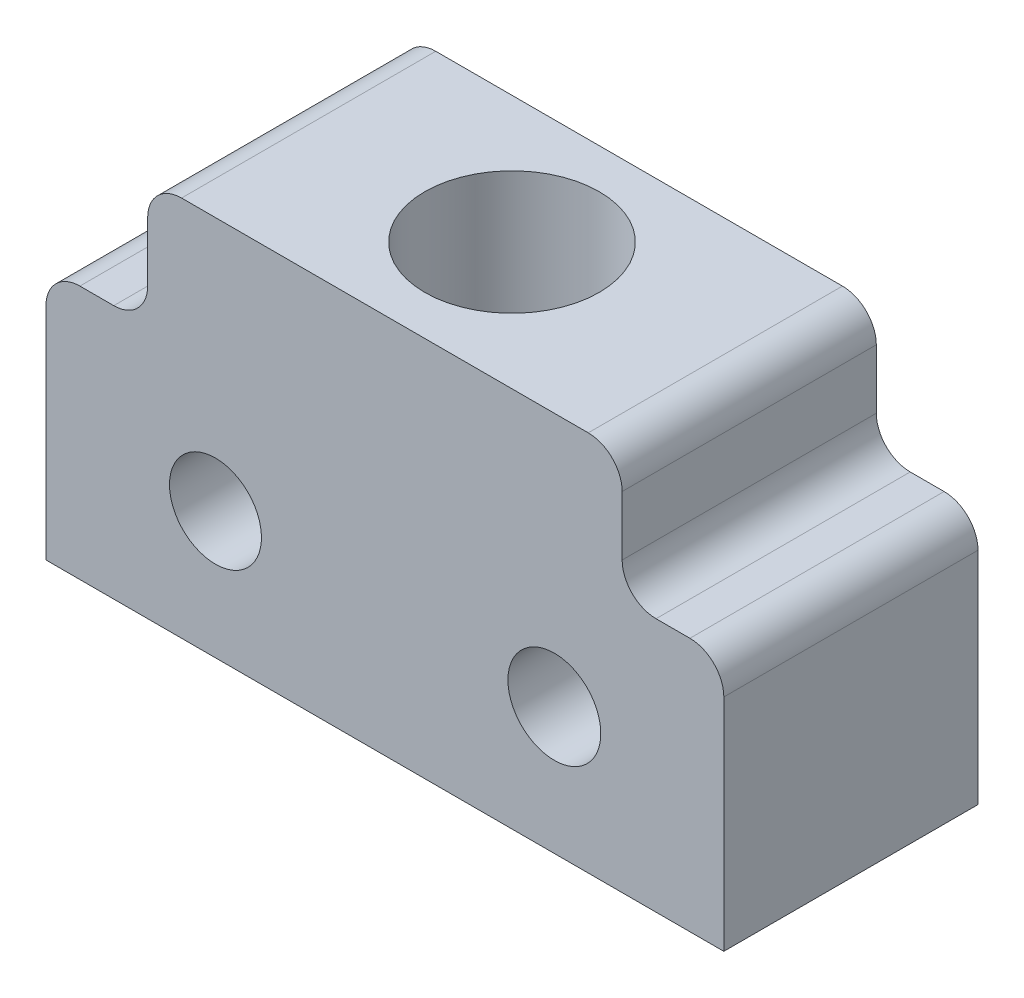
from build123d import *

# Parameters (mm, degrees)
SKETCH1_W           = 50.8
SKETCH1_H           = 19.05
BOSS_EXTRUDE1_DEPTH = 19.05
SKETCH3_R           = 3.175
CUT_EXTRUDE1_DEPTH  = 58.501695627
SKETCH4_R           = 3.130247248
CUT_EXTRUDE3_DEPTH  = 58.501695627
SKETCH6_W           = 35.56
SKETCH6_H           = 19.05
BOSS_EXTRUDE2_DEPTH = 9.525
SKETCH7_R           = 3.480096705
SKETCH7_R_2         = 3.446660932
CUT_EXTRUDE4_DEPTH  = 62.319435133
SKETCH8_R           = 4.445
CUT_EXTRUDE6_DEPTH  = 10.16
FILLET1_R           = 2.54
FILLET2_R           = 2.54
SKETCH9_R           = 6.35
CUT_EXTRUDE8_DEPTH  = 12.192
SKETCH10_R          = 6.5405
CUT_EXTRUDE9_DEPTH  = 10.668


with BuildPart() as part:
    # Sketch1 → Boss-Extrude1 (new body)
    with BuildSketch(Plane.XY):
        with Locations((25.4, 9.525)):
            Rectangle(SKETCH1_W, SKETCH1_H)
    extrude(amount=BOSS_EXTRUDE1_DEPTH)

    # Sketch3 → Cut-Extrude1 (cut, through all)
    with BuildSketch(Plane.XY.offset(19.05)):
        with Locations((12.7, 9.525)):
            Circle(SKETCH3_R)
    extrude(amount=-CUT_EXTRUDE1_DEPTH, mode=Mode.SUBTRACT)

    # Sketch4 → Cut-Extrude3 (cut, through all)
    with BuildSketch(Plane.XY.offset(19.05)):
        with Locations((38.1, 9.525)):
            Circle(SKETCH4_R)
    extrude(amount=-CUT_EXTRUDE3_DEPTH, mode=Mode.SUBTRACT)

    # Sketch6 → Boss-Extrude2 (add)
    with BuildSketch(Plane(origin=(0, 19.05, 0), x_dir=(1, 0, 0), z_dir=(0, 1, 0))):
        with Locations((25.4, -9.525)):
            Rectangle(SKETCH6_W, SKETCH6_H)
    extrude(amount=BOSS_EXTRUDE2_DEPTH)

    # Sketch7 → Cut-Extrude4 (cut, through all)
    with BuildSketch(Plane(origin=(0, 0, 0), x_dir=(-1, 0, 0), z_dir=(0, 0, -1))):
        with Locations((-38.1, 9.525)):
            Circle(SKETCH7_R)
        with Locations((-12.7, 9.525)):
            Circle(SKETCH7_R_2)
    extrude(amount=-CUT_EXTRUDE4_DEPTH, mode=Mode.SUBTRACT)

    # Sketch8 → Cut-Extrude6 (cut)
    with BuildSketch(Plane(origin=(0, 28.575, 0), x_dir=(1, 0, 0), z_dir=(0, 1, 0))):
        with Locations(Location((25.4, -9.525, 0), (0, 0, 270))):
            Circle(SKETCH8_R)
    extrude(amount=-CUT_EXTRUDE6_DEPTH, mode=Mode.SUBTRACT)

    # Fillet1
    fillet1_edges = [part.edges().sort_by_distance(p)[0] for p in [
        (7.62, 19.05, 9.525),
        (7.62, 28.575, 9.525),
        (0, 19.05, 9.525),
    ]]
    fillet(fillet1_edges, radius=FILLET1_R)

    # Fillet2
    fillet2_edges = [part.edges().sort_by_distance(p)[0] for p in [
        (43.18, 19.05, 9.525),
        (43.18, 28.575, 9.525),
        (50.8, 19.05, 9.525),
    ]]
    fillet(fillet2_edges, radius=FILLET2_R)

    # Sketch9 → Cut-Extrude8 (cut)
    with BuildSketch(Plane(origin=(0, 28.575, 0), x_dir=(1, 0, 0), z_dir=(0, 1, 0))):
        with Locations(Location((25.4, -9.525, 0), (0, 0, 270))):
            Circle(SKETCH9_R)
    extrude(amount=-CUT_EXTRUDE8_DEPTH, mode=Mode.SUBTRACT)

    # Sketch10 → Cut-Extrude9 (cut)
    with BuildSketch(Plane(origin=(0, 28.575, 0), x_dir=(1, 0, 0), z_dir=(0, 1, 0))):
        with Locations(Location((25.4, -9.525, 0), (0, 0, 270))):
            Circle(SKETCH10_R)
    extrude(amount=-CUT_EXTRUDE9_DEPTH, mode=Mode.SUBTRACT)


solid = part.part
